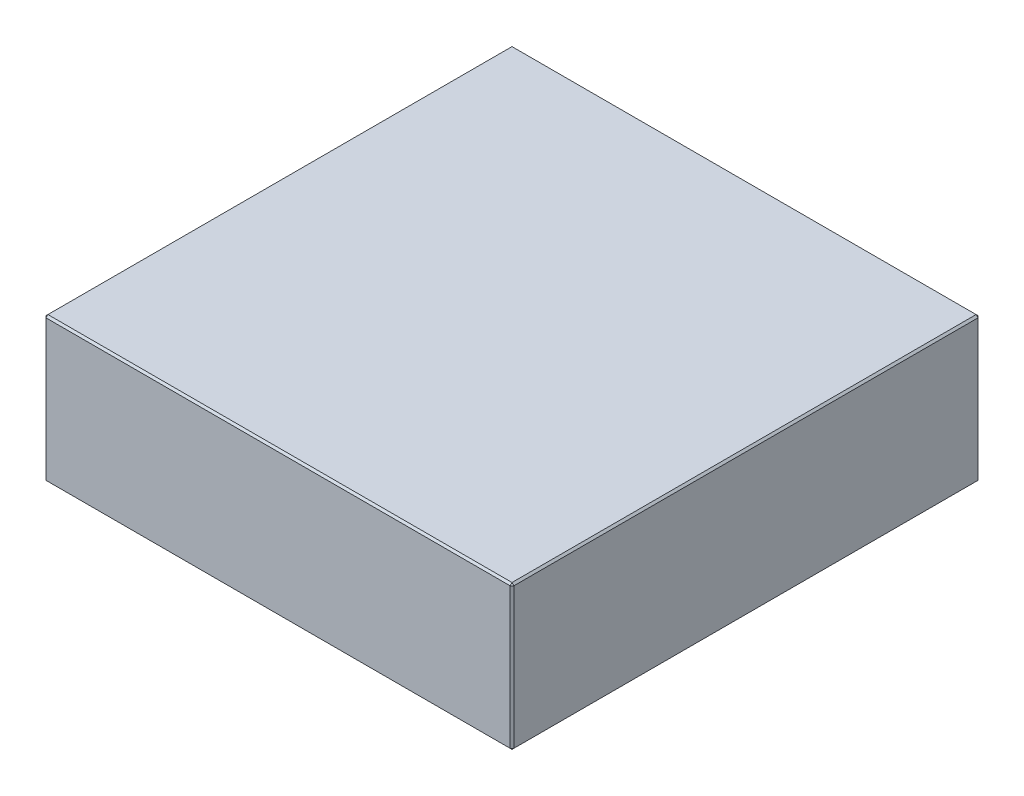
ISO-10303-21;
HEADER;
FILE_DESCRIPTION(('STEP AP214'),'2;1');
FILE_NAME('part.step','',(''),(''),'','','');
FILE_SCHEMA(('AUTOMOTIVE_DESIGN { 1 0 10303 214 1 1 1 1 }'));
ENDSEC;
DATA;
#1=APPLICATION_CONTEXT('core data for automotive mechanical design processes');
#2=APPLICATION_PROTOCOL_DEFINITION('international standard','automotive_design',2000,#1);
#3=PRODUCT_CONTEXT('',#1,'mechanical');
#4=PRODUCT('Part','Part','',(#3));
#5=PRODUCT_RELATED_PRODUCT_CATEGORY('part','',(#4));
#6=PRODUCT_DEFINITION_FORMATION('','',#4);
#7=PRODUCT_DEFINITION_CONTEXT('part definition',#1,'design');
#8=PRODUCT_DEFINITION('design','',#6,#7);
#9=PRODUCT_DEFINITION_SHAPE('','',#8);
#10=(LENGTH_UNIT() NAMED_UNIT(*) SI_UNIT(.MILLI.,.METRE.));
#11=(NAMED_UNIT(*) PLANE_ANGLE_UNIT() SI_UNIT($,.RADIAN.));
#12=(NAMED_UNIT(*) SI_UNIT($,.STERADIAN.) SOLID_ANGLE_UNIT());
#13=UNCERTAINTY_MEASURE_WITH_UNIT(LENGTH_MEASURE(1.E-05),#10,'distance_accuracy_value','');
#14=(GEOMETRIC_REPRESENTATION_CONTEXT(3) GLOBAL_UNCERTAINTY_ASSIGNED_CONTEXT((#13)) GLOBAL_UNIT_ASSIGNED_CONTEXT((#10,
#11,#12)) REPRESENTATION_CONTEXT('',''));
#15=CARTESIAN_POINT('',(0.,0.,0.));
#16=DIRECTION('',(0.,0.,1.));
#17=DIRECTION('',(1.,0.,0.));
#18=AXIS2_PLACEMENT_3D('',#15,#16,#17);
#19=CARTESIAN_POINT('',(-123.,76.,123.));
#20=DIRECTION('',(1.,0.,0.));
#21=DIRECTION('',(0.,0.,-1.));
#22=AXIS2_PLACEMENT_3D('',#19,#20,#21);
#23=PLANE('',#22);
#24=DIRECTION('',(0.,-1.,0.));
#25=VECTOR('',#24,1.);
#26=CARTESIAN_POINT('',(-123.,76.,-122.));
#27=LINE('',#26,#25);
#28=CARTESIAN_POINT('',(-123.,75.,-122.));
#29=VERTEX_POINT('',#28);
#30=CARTESIAN_POINT('',(-123.,1.00000000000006,-122.));
#31=VERTEX_POINT('',#30);
#32=EDGE_CURVE('E115',#29,#31,#27,.T.);
#33=ORIENTED_EDGE('',*,*,#32,.T.);
#34=DIRECTION('',(0.,0.,1.));
#35=VECTOR('',#34,1.);
#36=CARTESIAN_POINT('',(-123.,1.00000000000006,123.));
#37=LINE('',#36,#35);
#38=CARTESIAN_POINT('',(-123.,1.00000000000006,122.));
#39=VERTEX_POINT('',#38);
#40=EDGE_CURVE('E111',#31,#39,#37,.T.);
#41=ORIENTED_EDGE('',*,*,#40,.T.);
#42=DIRECTION('',(0.,1.,0.));
#43=VECTOR('',#42,1.);
#44=CARTESIAN_POINT('',(-123.,76.,122.));
#45=LINE('',#44,#43);
#46=CARTESIAN_POINT('',(-123.,75.,122.));
#47=VERTEX_POINT('',#46);
#48=EDGE_CURVE('E104',#39,#47,#45,.T.);
#49=ORIENTED_EDGE('',*,*,#48,.T.);
#50=DIRECTION('',(0.,0.,-1.));
#51=VECTOR('',#50,1.);
#52=CARTESIAN_POINT('',(-123.,75.,-123.));
#53=LINE('',#52,#51);
#54=EDGE_CURVE('E108',#47,#29,#53,.T.);
#55=ORIENTED_EDGE('',*,*,#54,.T.);
#56=EDGE_LOOP('',(#33,#41,#49,#55));
#57=FACE_BOUND('',#56,.T.);
#58=ADVANCED_FACE('F16',(#57),#23,.F.);
#59=CARTESIAN_POINT('',(123.,76.,123.));
#60=DIRECTION('',(0.,0.,-1.));
#61=DIRECTION('',(-1.,0.,0.));
#62=AXIS2_PLACEMENT_3D('',#59,#60,#61);
#63=PLANE('',#62);
#64=DIRECTION('',(-1.,0.,0.));
#65=VECTOR('',#64,1.);
#66=CARTESIAN_POINT('',(-123.,75.,123.));
#67=LINE('',#66,#65);
#68=CARTESIAN_POINT('',(122.,75.,123.));
#69=VERTEX_POINT('',#68);
#70=CARTESIAN_POINT('',(-122.,75.,123.));
#71=VERTEX_POINT('',#70);
#72=EDGE_CURVE('E165',#69,#71,#67,.T.);
#73=ORIENTED_EDGE('',*,*,#72,.T.);
#74=DIRECTION('',(0.,-1.,0.));
#75=VECTOR('',#74,1.);
#76=CARTESIAN_POINT('',(-122.,76.,123.));
#77=LINE('',#76,#75);
#78=CARTESIAN_POINT('',(-122.,1.,123.));
#79=VERTEX_POINT('',#78);
#80=EDGE_CURVE('E123',#71,#79,#77,.T.);
#81=ORIENTED_EDGE('',*,*,#80,.T.);
#82=DIRECTION('',(1.,0.,0.));
#83=VECTOR('',#82,1.);
#84=CARTESIAN_POINT('',(123.,1.,123.));
#85=LINE('',#84,#83);
#86=CARTESIAN_POINT('',(122.,1.,123.));
#87=VERTEX_POINT('',#86);
#88=EDGE_CURVE('E169',#79,#87,#85,.T.);
#89=ORIENTED_EDGE('',*,*,#88,.T.);
#90=DIRECTION('',(0.,1.,0.));
#91=VECTOR('',#90,1.);
#92=CARTESIAN_POINT('',(122.,76.,123.));
#93=LINE('',#92,#91);
#94=EDGE_CURVE('E167',#87,#69,#93,.T.);
#95=ORIENTED_EDGE('',*,*,#94,.T.);
#96=EDGE_LOOP('',(#73,#81,#89,#95));
#97=FACE_BOUND('',#96,.T.);
#98=ADVANCED_FACE('F276',(#97),#63,.F.);
#99=CARTESIAN_POINT('',(123.,76.,123.));
#100=DIRECTION('',(-1.,0.,0.));
#101=DIRECTION('',(0.,0.,1.));
#102=AXIS2_PLACEMENT_3D('',#99,#100,#101);
#103=PLANE('',#102);
#104=DIRECTION('',(0.,0.,-1.));
#105=VECTOR('',#104,1.);
#106=CARTESIAN_POINT('',(123.,1.,123.));
#107=LINE('',#106,#105);
#108=CARTESIAN_POINT('',(123.,1.,122.));
#109=VERTEX_POINT('',#108);
#110=CARTESIAN_POINT('',(123.,1.,-122.));
#111=VERTEX_POINT('',#110);
#112=EDGE_CURVE('E160',#109,#111,#107,.T.);
#113=ORIENTED_EDGE('',*,*,#112,.T.);
#114=DIRECTION('',(0.,1.,0.));
#115=VECTOR('',#114,1.);
#116=CARTESIAN_POINT('',(123.,76.,-122.));
#117=LINE('',#116,#115);
#118=CARTESIAN_POINT('',(123.,75.,-122.));
#119=VERTEX_POINT('',#118);
#120=EDGE_CURVE('E162',#111,#119,#117,.T.);
#121=ORIENTED_EDGE('',*,*,#120,.T.);
#122=DIRECTION('',(0.,0.,1.));
#123=VECTOR('',#122,1.);
#124=CARTESIAN_POINT('',(123.,75.,123.));
#125=LINE('',#124,#123);
#126=CARTESIAN_POINT('',(123.,75.,122.));
#127=VERTEX_POINT('',#126);
#128=EDGE_CURVE('E156',#119,#127,#125,.T.);
#129=ORIENTED_EDGE('',*,*,#128,.T.);
#130=DIRECTION('',(0.,-1.,0.));
#131=VECTOR('',#130,1.);
#132=CARTESIAN_POINT('',(123.,76.,122.));
#133=LINE('',#132,#131);
#134=EDGE_CURVE('E158',#127,#109,#133,.T.);
#135=ORIENTED_EDGE('',*,*,#134,.T.);
#136=EDGE_LOOP('',(#113,#121,#129,#135));
#137=FACE_BOUND('',#136,.T.);
#138=ADVANCED_FACE('F255',(#137),#103,.F.);
#139=CARTESIAN_POINT('',(123.,76.,-123.));
#140=DIRECTION('',(0.,0.,1.));
#141=DIRECTION('',(1.,0.,0.));
#142=AXIS2_PLACEMENT_3D('',#139,#140,#141);
#143=PLANE('',#142);
#144=DIRECTION('',(0.,-1.,0.));
#145=VECTOR('',#144,1.);
#146=CARTESIAN_POINT('',(122.,76.,-123.));
#147=LINE('',#146,#145);
#148=CARTESIAN_POINT('',(122.,75.,-123.));
#149=VERTEX_POINT('',#148);
#150=CARTESIAN_POINT('',(122.,1.,-123.));
#151=VERTEX_POINT('',#150);
#152=EDGE_CURVE('E149',#149,#151,#147,.T.);
#153=ORIENTED_EDGE('',*,*,#152,.T.);
#154=DIRECTION('',(-1.,0.,0.));
#155=VECTOR('',#154,1.);
#156=CARTESIAN_POINT('',(123.,1.,-123.));
#157=LINE('',#156,#155);
#158=CARTESIAN_POINT('',(-122.,1.,-123.));
#159=VERTEX_POINT('',#158);
#160=EDGE_CURVE('E154',#151,#159,#157,.T.);
#161=ORIENTED_EDGE('',*,*,#160,.T.);
#162=DIRECTION('',(0.,1.,0.));
#163=VECTOR('',#162,1.);
#164=CARTESIAN_POINT('',(-122.,76.,-123.));
#165=LINE('',#164,#163);
#166=CARTESIAN_POINT('',(-122.,75.,-123.));
#167=VERTEX_POINT('',#166);
#168=EDGE_CURVE('E151',#159,#167,#165,.T.);
#169=ORIENTED_EDGE('',*,*,#168,.T.);
#170=DIRECTION('',(1.,0.,0.));
#171=VECTOR('',#170,1.);
#172=CARTESIAN_POINT('',(123.,75.,-123.));
#173=LINE('',#172,#171);
#174=EDGE_CURVE('E147',#167,#149,#173,.T.);
#175=ORIENTED_EDGE('',*,*,#174,.T.);
#176=EDGE_LOOP('',(#153,#161,#169,#175));
#177=FACE_BOUND('',#176,.T.);
#178=ADVANCED_FACE('F285',(#177),#143,.F.);
#179=CARTESIAN_POINT('',(0.,76.,0.));
#180=DIRECTION('',(0.,1.,0.));
#181=DIRECTION('',(0.,0.,1.));
#182=AXIS2_PLACEMENT_3D('',#179,#180,#181);
#183=PLANE('',#182);
#184=DIRECTION('',(0.,0.,-1.));
#185=VECTOR('',#184,1.);
#186=CARTESIAN_POINT('',(122.,76.,-123.));
#187=LINE('',#186,#185);
#188=CARTESIAN_POINT('',(122.,76.,122.));
#189=VERTEX_POINT('',#188);
#190=CARTESIAN_POINT('',(122.,76.,-122.));
#191=VERTEX_POINT('',#190);
#192=EDGE_CURVE('E25',#189,#191,#187,.T.);
#193=ORIENTED_EDGE('',*,*,#192,.T.);
#194=DIRECTION('',(-1.,0.,0.));
#195=VECTOR('',#194,1.);
#196=CARTESIAN_POINT('',(-123.,76.,-122.));
#197=LINE('',#196,#195);
#198=CARTESIAN_POINT('',(-122.,76.,-122.));
#199=VERTEX_POINT('',#198);
#200=EDGE_CURVE('E10',#191,#199,#197,.T.);
#201=ORIENTED_EDGE('',*,*,#200,.T.);
#202=DIRECTION('',(0.,0.,1.));
#203=VECTOR('',#202,1.);
#204=CARTESIAN_POINT('',(-122.,76.,123.));
#205=LINE('',#204,#203);
#206=CARTESIAN_POINT('',(-122.,76.,122.));
#207=VERTEX_POINT('',#206);
#208=EDGE_CURVE('E181',#199,#207,#205,.T.);
#209=ORIENTED_EDGE('',*,*,#208,.T.);
#210=DIRECTION('',(1.,0.,0.));
#211=VECTOR('',#210,1.);
#212=CARTESIAN_POINT('',(123.,76.,122.));
#213=LINE('',#212,#211);
#214=EDGE_CURVE('E36',#207,#189,#213,.T.);
#215=ORIENTED_EDGE('',*,*,#214,.T.);
#216=EDGE_LOOP('',(#193,#201,#209,#215));
#217=FACE_BOUND('',#216,.T.);
#218=ADVANCED_FACE('F351',(#217),#183,.T.);
#219=CARTESIAN_POINT('',(0.,0.,0.));
#220=DIRECTION('',(0.,1.,0.));
#221=DIRECTION('',(0.,0.,1.));
#222=AXIS2_PLACEMENT_3D('',#219,#220,#221);
#223=PLANE('',#222);
#224=DIRECTION('',(0.,0.,1.));
#225=VECTOR('',#224,1.);
#226=CARTESIAN_POINT('',(122.,0.,0.));
#227=LINE('',#226,#225);
#228=CARTESIAN_POINT('',(122.,0.,-122.));
#229=VERTEX_POINT('',#228);
#230=CARTESIAN_POINT('',(122.,0.,122.));
#231=VERTEX_POINT('',#230);
#232=EDGE_CURVE('E172',#229,#231,#227,.T.);
#233=ORIENTED_EDGE('',*,*,#232,.T.);
#234=DIRECTION('',(-1.,0.,0.));
#235=VECTOR('',#234,1.);
#236=CARTESIAN_POINT('',(0.,0.,122.));
#237=LINE('',#236,#235);
#238=CARTESIAN_POINT('',(-122.,0.,122.));
#239=VERTEX_POINT('',#238);
#240=EDGE_CURVE('E178',#231,#239,#237,.T.);
#241=ORIENTED_EDGE('',*,*,#240,.T.);
#242=DIRECTION('',(0.,0.,-1.));
#243=VECTOR('',#242,1.);
#244=CARTESIAN_POINT('',(-122.,0.,0.));
#245=LINE('',#244,#243);
#246=CARTESIAN_POINT('',(-122.,0.,-122.));
#247=VERTEX_POINT('',#246);
#248=EDGE_CURVE('E176',#239,#247,#245,.T.);
#249=ORIENTED_EDGE('',*,*,#248,.T.);
#250=DIRECTION('',(1.,0.,0.));
#251=VECTOR('',#250,1.);
#252=CARTESIAN_POINT('',(0.,0.,-122.));
#253=LINE('',#252,#251);
#254=EDGE_CURVE('E174',#247,#229,#253,.T.);
#255=ORIENTED_EDGE('',*,*,#254,.T.);
#256=EDGE_LOOP('',(#233,#241,#249,#255));
#257=FACE_BOUND('',#256,.T.);
#258=ADVANCED_FACE('F247',(#257),#223,.F.);
#259=CARTESIAN_POINT('',(123.,76.,122.));
#260=DIRECTION('',(-0.707106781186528,0.,-0.707106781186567));
#261=DIRECTION('',(0.,-1.,0.));
#262=AXIS2_PLACEMENT_3D('',#259,#260,#261);
#263=PLANE('',#262);
#264=DIRECTION('',(-0.707106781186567,0.,0.707106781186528));
#265=VECTOR('',#264,1.);
#266=CARTESIAN_POINT('',(122.,75.,123.));
#267=LINE('',#266,#265);
#268=EDGE_CURVE('E20',#69,#127,#267,.F.);
#269=ORIENTED_EDGE('',*,*,#268,.F.);
#270=ORIENTED_EDGE('',*,*,#94,.F.);
#271=DIRECTION('',(0.707106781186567,0.,-0.707106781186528));
#272=VECTOR('',#271,1.);
#273=CARTESIAN_POINT('',(122.,1.,123.));
#274=LINE('',#273,#272);
#275=EDGE_CURVE('E143',#109,#87,#274,.F.);
#276=ORIENTED_EDGE('',*,*,#275,.F.);
#277=ORIENTED_EDGE('',*,*,#134,.F.);
#278=EDGE_LOOP('',(#269,#270,#276,#277));
#279=FACE_BOUND('',#278,.T.);
#280=ADVANCED_FACE('F18',(#279),#263,.F.);
#281=CARTESIAN_POINT('',(122.,75.,123.));
#282=DIRECTION('',(0.577350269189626,0.577350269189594,0.577350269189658));
#283=DIRECTION('',(0.707106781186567,0.,-0.707106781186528));
#284=AXIS2_PLACEMENT_3D('',#281,#282,#283);
#285=PLANE('',#284);
#286=DIRECTION('',(0.,-0.707106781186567,0.707106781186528));
#287=VECTOR('',#286,1.);
#288=CARTESIAN_POINT('',(122.,75.,123.));
#289=LINE('',#288,#287);
#290=EDGE_CURVE('E227',#69,#189,#289,.F.);
#291=ORIENTED_EDGE('',*,*,#290,.F.);
#292=ORIENTED_EDGE('',*,*,#268,.T.);
#293=DIRECTION('',(-0.707106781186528,0.707106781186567,0.));
#294=VECTOR('',#293,1.);
#295=CARTESIAN_POINT('',(122.5,75.5,122.));
#296=LINE('',#295,#294);
#297=EDGE_CURVE('E229',#189,#127,#296,.F.);
#298=ORIENTED_EDGE('',*,*,#297,.F.);
#299=EDGE_LOOP('',(#291,#292,#298));
#300=FACE_BOUND('',#299,.T.);
#301=ADVANCED_FACE('F271',(#300),#285,.T.);
#302=CARTESIAN_POINT('',(122.,1.,123.));
#303=DIRECTION('',(0.577350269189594,-0.577350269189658,0.577350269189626));
#304=DIRECTION('',(0.,-0.707106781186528,-0.707106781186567));
#305=AXIS2_PLACEMENT_3D('',#302,#303,#304);
#306=PLANE('',#305);
#307=DIRECTION('',(-0.707106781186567,-0.707106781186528,0.));
#308=VECTOR('',#307,1.);
#309=CARTESIAN_POINT('',(122.5,0.5,122.));
#310=LINE('',#309,#308);
#311=EDGE_CURVE('E221',#109,#231,#310,.T.);
#312=ORIENTED_EDGE('',*,*,#311,.F.);
#313=ORIENTED_EDGE('',*,*,#275,.T.);
#314=DIRECTION('',(0.,0.707106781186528,0.707106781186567));
#315=VECTOR('',#314,1.);
#316=CARTESIAN_POINT('',(122.,1.,123.));
#317=LINE('',#316,#315);
#318=EDGE_CURVE('E224',#231,#87,#317,.T.);
#319=ORIENTED_EDGE('',*,*,#318,.F.);
#320=EDGE_LOOP('',(#312,#313,#319));
#321=FACE_BOUND('',#320,.T.);
#322=ADVANCED_FACE('F236',(#321),#306,.T.);
#323=CARTESIAN_POINT('',(122.,76.,0.));
#324=DIRECTION('',(0.707106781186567,0.707106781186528,0.));
#325=DIRECTION('',(0.,0.,1.));
#326=AXIS2_PLACEMENT_3D('',#323,#324,#325);
#327=PLANE('',#326);
#328=ORIENTED_EDGE('',*,*,#297,.T.);
#329=ORIENTED_EDGE('',*,*,#128,.F.);
#330=DIRECTION('',(0.707106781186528,-0.707106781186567,0.));
#331=VECTOR('',#330,1.);
#332=CARTESIAN_POINT('',(123.,75.,-122.));
#333=LINE('',#332,#331);
#334=EDGE_CURVE('E216',#191,#119,#333,.T.);
#335=ORIENTED_EDGE('',*,*,#334,.F.);
#336=ORIENTED_EDGE('',*,*,#192,.F.);
#337=EDGE_LOOP('',(#328,#329,#335,#336));
#338=FACE_BOUND('',#337,.T.);
#339=ADVANCED_FACE('F266',(#338),#327,.T.);
#340=CARTESIAN_POINT('',(0.,76.,122.));
#341=DIRECTION('',(0.,0.707106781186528,0.707106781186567));
#342=DIRECTION('',(-1.,0.,0.));
#343=AXIS2_PLACEMENT_3D('',#340,#341,#342);
#344=PLANE('',#343);
#345=ORIENTED_EDGE('',*,*,#290,.T.);
#346=ORIENTED_EDGE('',*,*,#214,.F.);
#347=DIRECTION('',(0.,0.707106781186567,-0.707106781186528));
#348=VECTOR('',#347,1.);
#349=CARTESIAN_POINT('',(-122.,75.5,122.5));
#350=LINE('',#349,#348);
#351=EDGE_CURVE('E127',#71,#207,#350,.T.);
#352=ORIENTED_EDGE('',*,*,#351,.F.);
#353=ORIENTED_EDGE('',*,*,#72,.F.);
#354=EDGE_LOOP('',(#345,#346,#352,#353));
#355=FACE_BOUND('',#354,.T.);
#356=ADVANCED_FACE('F274',(#355),#344,.T.);
#357=CARTESIAN_POINT('',(-122.,76.,123.));
#358=DIRECTION('',(0.707106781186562,0.,-0.707106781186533));
#359=DIRECTION('',(0.,-1.,0.));
#360=AXIS2_PLACEMENT_3D('',#357,#358,#359);
#361=PLANE('',#360);
#362=DIRECTION('',(0.707106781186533,0.,0.707106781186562));
#363=VECTOR('',#362,1.);
#364=CARTESIAN_POINT('',(-122.,1.,123.));
#365=LINE('',#364,#363);
#366=EDGE_CURVE('E128',#79,#39,#365,.F.);
#367=ORIENTED_EDGE('',*,*,#366,.F.);
#368=ORIENTED_EDGE('',*,*,#80,.F.);
#369=DIRECTION('',(-0.707106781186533,0.,-0.707106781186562));
#370=VECTOR('',#369,1.);
#371=CARTESIAN_POINT('',(-123.,75.,122.));
#372=LINE('',#371,#370);
#373=EDGE_CURVE('E119',#47,#71,#372,.F.);
#374=ORIENTED_EDGE('',*,*,#373,.F.);
#375=ORIENTED_EDGE('',*,*,#48,.F.);
#376=EDGE_LOOP('',(#367,#368,#374,#375));
#377=FACE_BOUND('',#376,.T.);
#378=ADVANCED_FACE('F121',(#377),#361,.F.);
#379=CARTESIAN_POINT('',(123.,1.,123.));
#380=DIRECTION('',(0.,0.707106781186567,-0.707106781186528));
#381=DIRECTION('',(1.,0.,0.));
#382=AXIS2_PLACEMENT_3D('',#379,#380,#381);
#383=PLANE('',#382);
#384=ORIENTED_EDGE('',*,*,#318,.T.);
#385=ORIENTED_EDGE('',*,*,#88,.F.);
#386=DIRECTION('',(0.,-0.707106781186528,-0.707106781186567));
#387=VECTOR('',#386,1.);
#388=CARTESIAN_POINT('',(-122.,1.,123.));
#389=LINE('',#388,#387);
#390=EDGE_CURVE('E212',#239,#79,#389,.F.);
#391=ORIENTED_EDGE('',*,*,#390,.F.);
#392=ORIENTED_EDGE('',*,*,#240,.F.);
#393=EDGE_LOOP('',(#384,#385,#391,#392));
#394=FACE_BOUND('',#393,.T.);
#395=ADVANCED_FACE('F244',(#394),#383,.F.);
#396=CARTESIAN_POINT('',(123.,1.,123.));
#397=DIRECTION('',(-0.707106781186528,0.707106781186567,0.));
#398=DIRECTION('',(0.,0.,-1.));
#399=AXIS2_PLACEMENT_3D('',#396,#397,#398);
#400=PLANE('',#399);
#401=ORIENTED_EDGE('',*,*,#311,.T.);
#402=ORIENTED_EDGE('',*,*,#232,.F.);
#403=DIRECTION('',(0.707106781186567,0.707106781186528,0.));
#404=VECTOR('',#403,1.);
#405=CARTESIAN_POINT('',(122.5,0.5,-122.));
#406=LINE('',#405,#404);
#407=EDGE_CURVE('E209',#111,#229,#406,.F.);
#408=ORIENTED_EDGE('',*,*,#407,.F.);
#409=ORIENTED_EDGE('',*,*,#112,.F.);
#410=EDGE_LOOP('',(#401,#402,#408,#409));
#411=FACE_BOUND('',#410,.T.);
#412=ADVANCED_FACE('F252',(#411),#400,.F.);
#413=CARTESIAN_POINT('',(122.,76.,-123.));
#414=DIRECTION('',(-0.707106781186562,0.,0.707106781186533));
#415=DIRECTION('',(0.,-1.,0.));
#416=AXIS2_PLACEMENT_3D('',#413,#414,#415);
#417=PLANE('',#416);
#418=DIRECTION('',(0.707106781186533,0.,0.707106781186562));
#419=VECTOR('',#418,1.);
#420=CARTESIAN_POINT('',(123.,75.,-122.));
#421=LINE('',#420,#419);
#422=EDGE_CURVE('E218',#119,#149,#421,.F.);
#423=ORIENTED_EDGE('',*,*,#422,.F.);
#424=ORIENTED_EDGE('',*,*,#120,.F.);
#425=DIRECTION('',(-0.707106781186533,0.,-0.707106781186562));
#426=VECTOR('',#425,1.);
#427=CARTESIAN_POINT('',(122.,1.,-123.));
#428=LINE('',#427,#426);
#429=EDGE_CURVE('E206',#151,#111,#428,.F.);
#430=ORIENTED_EDGE('',*,*,#429,.F.);
#431=ORIENTED_EDGE('',*,*,#152,.F.);
#432=EDGE_LOOP('',(#423,#424,#430,#431));
#433=FACE_BOUND('',#432,.T.);
#434=ADVANCED_FACE('F259',(#433),#417,.F.);
#435=CARTESIAN_POINT('',(123.,75.,-122.));
#436=DIRECTION('',(0.577350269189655,0.577350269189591,-0.577350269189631));
#437=DIRECTION('',(-0.707106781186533,0.,-0.707106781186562));
#438=AXIS2_PLACEMENT_3D('',#435,#436,#437);
#439=PLANE('',#438);
#440=ORIENTED_EDGE('',*,*,#334,.T.);
#441=ORIENTED_EDGE('',*,*,#422,.T.);
#442=DIRECTION('',(0.,0.707106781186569,0.707106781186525));
#443=VECTOR('',#442,1.);
#444=CARTESIAN_POINT('',(122.,75.5,-122.5));
#445=LINE('',#444,#443);
#446=EDGE_CURVE('E135',#191,#149,#445,.F.);
#447=ORIENTED_EDGE('',*,*,#446,.F.);
#448=EDGE_LOOP('',(#440,#441,#447));
#449=FACE_BOUND('',#448,.T.);
#450=ADVANCED_FACE('F326',(#449),#439,.T.);
#451=CARTESIAN_POINT('',(-123.,75.,122.));
#452=DIRECTION('',(-0.577350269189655,0.577350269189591,0.577350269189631));
#453=DIRECTION('',(0.707106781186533,0.,0.707106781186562));
#454=AXIS2_PLACEMENT_3D('',#451,#452,#453);
#455=PLANE('',#454);
#456=ORIENTED_EDGE('',*,*,#373,.T.);
#457=ORIENTED_EDGE('',*,*,#351,.T.);
#458=DIRECTION('',(-0.707106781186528,-0.707106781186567,0.));
#459=VECTOR('',#458,1.);
#460=CARTESIAN_POINT('',(-123.,75.,122.));
#461=LINE('',#460,#459);
#462=EDGE_CURVE('E131',#47,#207,#461,.F.);
#463=ORIENTED_EDGE('',*,*,#462,.F.);
#464=EDGE_LOOP('',(#456,#457,#463));
#465=FACE_BOUND('',#464,.T.);
#466=ADVANCED_FACE('F132',(#465),#455,.T.);
#467=CARTESIAN_POINT('',(-122.,1.,123.));
#468=DIRECTION('',(-0.577350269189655,-0.577350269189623,0.577350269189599));
#469=DIRECTION('',(0.707106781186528,-0.707106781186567,0.));
#470=AXIS2_PLACEMENT_3D('',#467,#468,#469);
#471=PLANE('',#470);
#472=ORIENTED_EDGE('',*,*,#390,.T.);
#473=ORIENTED_EDGE('',*,*,#366,.T.);
#474=DIRECTION('',(-0.707106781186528,0.707106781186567,0.));
#475=VECTOR('',#474,1.);
#476=CARTESIAN_POINT('',(-122.5,0.500000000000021,122.));
#477=LINE('',#476,#475);
#478=EDGE_CURVE('E136',#239,#39,#477,.T.);
#479=ORIENTED_EDGE('',*,*,#478,.F.);
#480=EDGE_LOOP('',(#472,#473,#479));
#481=FACE_BOUND('',#480,.T.);
#482=ADVANCED_FACE('F319',(#481),#471,.T.);
#483=CARTESIAN_POINT('',(122.,1.,-123.));
#484=DIRECTION('',(0.577350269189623,-0.577350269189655,-0.577350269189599));
#485=DIRECTION('',(0.707106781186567,0.707106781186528,0.));
#486=AXIS2_PLACEMENT_3D('',#483,#484,#485);
#487=PLANE('',#486);
#488=ORIENTED_EDGE('',*,*,#429,.T.);
#489=ORIENTED_EDGE('',*,*,#407,.T.);
#490=DIRECTION('',(0.,-0.70710678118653,0.707106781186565));
#491=VECTOR('',#490,1.);
#492=CARTESIAN_POINT('',(122.,1.,-123.));
#493=LINE('',#492,#491);
#494=EDGE_CURVE('E199',#151,#229,#493,.T.);
#495=ORIENTED_EDGE('',*,*,#494,.F.);
#496=EDGE_LOOP('',(#488,#489,#495));
#497=FACE_BOUND('',#496,.T.);
#498=ADVANCED_FACE('F315',(#497),#487,.T.);
#499=CARTESIAN_POINT('',(0.,76.,-122.));
#500=DIRECTION('',(0.,0.707106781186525,-0.70710678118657));
#501=DIRECTION('',(1.,0.,0.));
#502=AXIS2_PLACEMENT_3D('',#499,#500,#501);
#503=PLANE('',#502);
#504=ORIENTED_EDGE('',*,*,#446,.T.);
#505=ORIENTED_EDGE('',*,*,#174,.F.);
#506=DIRECTION('',(0.,-0.707106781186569,-0.707106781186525));
#507=VECTOR('',#506,1.);
#508=CARTESIAN_POINT('',(-122.,75.,-123.));
#509=LINE('',#508,#507);
#510=EDGE_CURVE('E196',#199,#167,#509,.T.);
#511=ORIENTED_EDGE('',*,*,#510,.F.);
#512=ORIENTED_EDGE('',*,*,#200,.F.);
#513=EDGE_LOOP('',(#504,#505,#511,#512));
#514=FACE_BOUND('',#513,.T.);
#515=ADVANCED_FACE('F312',(#514),#503,.T.);
#516=CARTESIAN_POINT('',(-122.,76.,0.));
#517=DIRECTION('',(-0.707106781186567,0.707106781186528,0.));
#518=DIRECTION('',(0.,0.,-1.));
#519=AXIS2_PLACEMENT_3D('',#516,#517,#518);
#520=PLANE('',#519);
#521=ORIENTED_EDGE('',*,*,#462,.T.);
#522=ORIENTED_EDGE('',*,*,#208,.F.);
#523=DIRECTION('',(0.707106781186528,0.707106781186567,0.));
#524=VECTOR('',#523,1.);
#525=CARTESIAN_POINT('',(-122.5,75.5,-122.));
#526=LINE('',#525,#524);
#527=EDGE_CURVE('E139',#29,#199,#526,.T.);
#528=ORIENTED_EDGE('',*,*,#527,.F.);
#529=ORIENTED_EDGE('',*,*,#54,.F.);
#530=EDGE_LOOP('',(#521,#522,#528,#529));
#531=FACE_BOUND('',#530,.T.);
#532=ADVANCED_FACE('F138',(#531),#520,.T.);
#533=CARTESIAN_POINT('',(-123.,1.00000000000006,123.));
#534=DIRECTION('',(0.707106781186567,0.707106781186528,0.));
#535=DIRECTION('',(0.,0.,1.));
#536=AXIS2_PLACEMENT_3D('',#533,#534,#535);
#537=PLANE('',#536);
#538=ORIENTED_EDGE('',*,*,#478,.T.);
#539=ORIENTED_EDGE('',*,*,#40,.F.);
#540=DIRECTION('',(0.707106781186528,-0.707106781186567,0.));
#541=VECTOR('',#540,1.);
#542=CARTESIAN_POINT('',(-123.,1.00000000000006,-122.));
#543=LINE('',#542,#541);
#544=EDGE_CURVE('E192',#247,#31,#543,.F.);
#545=ORIENTED_EDGE('',*,*,#544,.F.);
#546=ORIENTED_EDGE('',*,*,#248,.F.);
#547=EDGE_LOOP('',(#538,#539,#545,#546));
#548=FACE_BOUND('',#547,.T.);
#549=ADVANCED_FACE('F305',(#548),#537,.F.);
#550=CARTESIAN_POINT('',(123.,1.,-123.));
#551=DIRECTION('',(0.,0.707106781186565,0.70710678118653));
#552=DIRECTION('',(-1.,0.,0.));
#553=AXIS2_PLACEMENT_3D('',#550,#551,#552);
#554=PLANE('',#553);
#555=ORIENTED_EDGE('',*,*,#494,.T.);
#556=ORIENTED_EDGE('',*,*,#254,.F.);
#557=DIRECTION('',(0.,0.70710678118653,-0.707106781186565));
#558=VECTOR('',#557,1.);
#559=CARTESIAN_POINT('',(-122.,0.49999999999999,-122.5));
#560=LINE('',#559,#558);
#561=EDGE_CURVE('E189',#159,#247,#560,.F.);
#562=ORIENTED_EDGE('',*,*,#561,.F.);
#563=ORIENTED_EDGE('',*,*,#160,.F.);
#564=EDGE_LOOP('',(#555,#556,#562,#563));
#565=FACE_BOUND('',#564,.T.);
#566=ADVANCED_FACE('F301',(#565),#554,.F.);
#567=CARTESIAN_POINT('',(-122.,75.,-123.));
#568=DIRECTION('',(-0.577350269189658,0.577350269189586,-0.577350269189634));
#569=DIRECTION('',(-0.707106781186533,0.,0.707106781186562));
#570=AXIS2_PLACEMENT_3D('',#567,#568,#569);
#571=PLANE('',#570);
#572=ORIENTED_EDGE('',*,*,#527,.T.);
#573=ORIENTED_EDGE('',*,*,#510,.T.);
#574=DIRECTION('',(0.707106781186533,0.,-0.707106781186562));
#575=VECTOR('',#574,1.);
#576=CARTESIAN_POINT('',(-122.,75.,-123.));
#577=LINE('',#576,#575);
#578=EDGE_CURVE('E187',#29,#167,#577,.T.);
#579=ORIENTED_EDGE('',*,*,#578,.F.);
#580=EDGE_LOOP('',(#572,#573,#579));
#581=FACE_BOUND('',#580,.T.);
#582=ADVANCED_FACE('F297',(#581),#571,.T.);
#583=CARTESIAN_POINT('',(-123.,1.00000000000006,-122.));
#584=DIRECTION('',(-0.577350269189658,-0.577350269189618,-0.577350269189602));
#585=DIRECTION('',(0.707106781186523,-0.707106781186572,0.));
#586=AXIS2_PLACEMENT_3D('',#583,#584,#585);
#587=PLANE('',#586);
#588=ORIENTED_EDGE('',*,*,#561,.T.);
#589=ORIENTED_EDGE('',*,*,#544,.T.);
#590=DIRECTION('',(-0.707106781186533,0.,0.707106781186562));
#591=VECTOR('',#590,1.);
#592=CARTESIAN_POINT('',(-123.,1.00000000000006,-122.));
#593=LINE('',#592,#591);
#594=EDGE_CURVE('E185',#159,#31,#593,.T.);
#595=ORIENTED_EDGE('',*,*,#594,.F.);
#596=EDGE_LOOP('',(#588,#589,#595));
#597=FACE_BOUND('',#596,.T.);
#598=ADVANCED_FACE('F293',(#597),#587,.T.);
#599=CARTESIAN_POINT('',(-123.,76.,-122.));
#600=DIRECTION('',(0.707106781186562,0.,0.707106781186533));
#601=DIRECTION('',(0.,-1.,0.));
#602=AXIS2_PLACEMENT_3D('',#599,#600,#601);
#603=PLANE('',#602);
#604=ORIENTED_EDGE('',*,*,#578,.T.);
#605=ORIENTED_EDGE('',*,*,#168,.F.);
#606=ORIENTED_EDGE('',*,*,#594,.T.);
#607=ORIENTED_EDGE('',*,*,#32,.F.);
#608=EDGE_LOOP('',(#604,#605,#606,#607));
#609=FACE_BOUND('',#608,.T.);
#610=ADVANCED_FACE('F290',(#609),#603,.F.);
#611=CLOSED_SHELL('',(#58,#98,#138,#178,#218,#258,#280,#301,#322,#339,#356,#378,#395,#412,#434,
#450,#466,#482,#498,#515,#532,#549,#566,#582,#598,#610));
#612=MANIFOLD_SOLID_BREP('B1',#611);
#613=ADVANCED_BREP_SHAPE_REPRESENTATION('',(#18,#612),#14);
#614=SHAPE_DEFINITION_REPRESENTATION(#9,#613);
ENDSEC;
END-ISO-10303-21;
